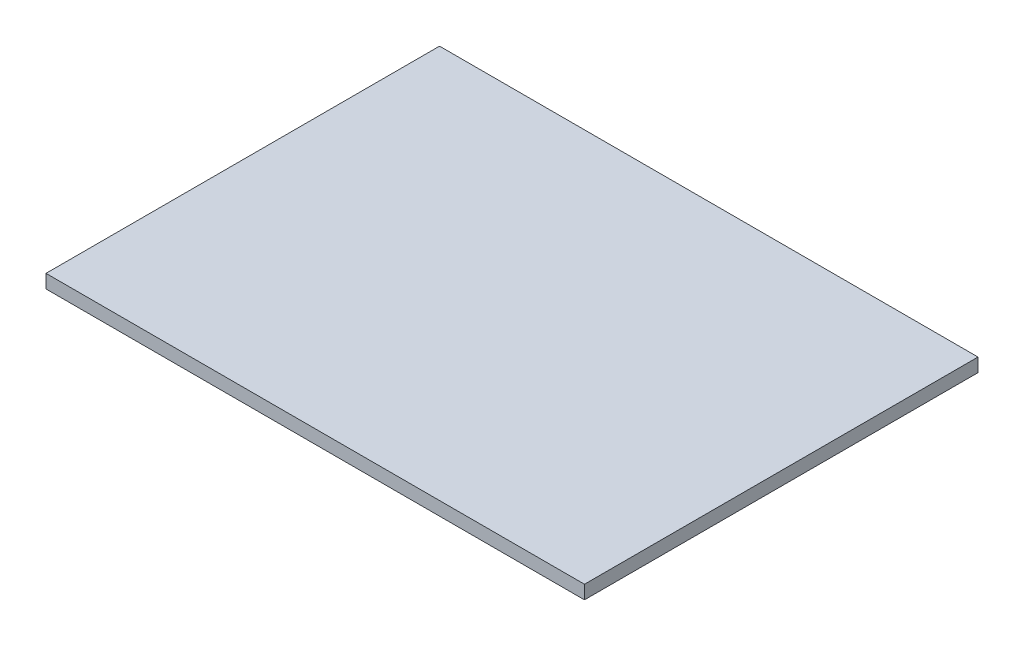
ISO-10303-21;
HEADER;
FILE_DESCRIPTION(('STEP AP214'),'2;1');
FILE_NAME('part.step','',(''),(''),'','','');
FILE_SCHEMA(('AUTOMOTIVE_DESIGN { 1 0 10303 214 1 1 1 1 }'));
ENDSEC;
DATA;
#1=APPLICATION_CONTEXT('core data for automotive mechanical design processes');
#2=APPLICATION_PROTOCOL_DEFINITION('international standard','automotive_design',2000,#1);
#3=PRODUCT_CONTEXT('',#1,'mechanical');
#4=PRODUCT('Part','Part','',(#3));
#5=PRODUCT_RELATED_PRODUCT_CATEGORY('part','',(#4));
#6=PRODUCT_DEFINITION_FORMATION('','',#4);
#7=PRODUCT_DEFINITION_CONTEXT('part definition',#1,'design');
#8=PRODUCT_DEFINITION('design','',#6,#7);
#9=PRODUCT_DEFINITION_SHAPE('','',#8);
#10=(LENGTH_UNIT() NAMED_UNIT(*) SI_UNIT(.MILLI.,.METRE.));
#11=(NAMED_UNIT(*) PLANE_ANGLE_UNIT() SI_UNIT($,.RADIAN.));
#12=(NAMED_UNIT(*) SI_UNIT($,.STERADIAN.) SOLID_ANGLE_UNIT());
#13=UNCERTAINTY_MEASURE_WITH_UNIT(LENGTH_MEASURE(1.E-05),#10,'distance_accuracy_value','');
#14=(GEOMETRIC_REPRESENTATION_CONTEXT(3) GLOBAL_UNCERTAINTY_ASSIGNED_CONTEXT((#13)) GLOBAL_UNIT_ASSIGNED_CONTEXT((#10,
#11,#12)) REPRESENTATION_CONTEXT('',''));
#15=CARTESIAN_POINT('',(0.,0.,0.));
#16=DIRECTION('',(0.,0.,1.));
#17=DIRECTION('',(1.,0.,0.));
#18=AXIS2_PLACEMENT_3D('',#15,#16,#17);
#19=CARTESIAN_POINT('',(-39.75,2.,29.05));
#20=DIRECTION('',(1.,0.,0.));
#21=DIRECTION('',(0.,0.,-1.));
#22=AXIS2_PLACEMENT_3D('',#19,#20,#21);
#23=PLANE('',#22);
#24=DIRECTION('',(0.,0.,1.));
#25=VECTOR('',#24,1.);
#26=CARTESIAN_POINT('',(-39.75,0.,29.05));
#27=LINE('',#26,#25);
#28=CARTESIAN_POINT('',(-39.75,0.,-29.05));
#29=VERTEX_POINT('',#28);
#30=CARTESIAN_POINT('',(-39.75,0.,29.05));
#31=VERTEX_POINT('',#30);
#32=EDGE_CURVE('E98',#29,#31,#27,.T.);
#33=ORIENTED_EDGE('',*,*,#32,.T.);
#34=DIRECTION('',(0.,-1.,0.));
#35=VECTOR('',#34,1.);
#36=CARTESIAN_POINT('',(-39.75,2.,29.05));
#37=LINE('',#36,#35);
#38=CARTESIAN_POINT('',(-39.75,2.,29.05));
#39=VERTEX_POINT('',#38);
#40=EDGE_CURVE('E11',#39,#31,#37,.T.);
#41=ORIENTED_EDGE('',*,*,#40,.F.);
#42=DIRECTION('',(0.,0.,1.));
#43=VECTOR('',#42,1.);
#44=CARTESIAN_POINT('',(-39.75,2.,29.05));
#45=LINE('',#44,#43);
#46=CARTESIAN_POINT('',(-39.75,2.,-29.05));
#47=VERTEX_POINT('',#46);
#48=EDGE_CURVE('E86',#47,#39,#45,.T.);
#49=ORIENTED_EDGE('',*,*,#48,.F.);
#50=DIRECTION('',(0.,-1.,0.));
#51=VECTOR('',#50,1.);
#52=CARTESIAN_POINT('',(-39.75,2.,-29.05));
#53=LINE('',#52,#51);
#54=EDGE_CURVE('E94',#47,#29,#53,.T.);
#55=ORIENTED_EDGE('',*,*,#54,.T.);
#56=EDGE_LOOP('',(#33,#41,#49,#55));
#57=FACE_BOUND('',#56,.T.);
#58=ADVANCED_FACE('F35',(#57),#23,.F.);
#59=CARTESIAN_POINT('',(39.75,2.,29.05));
#60=DIRECTION('',(0.,0.,-1.));
#61=DIRECTION('',(-1.,0.,0.));
#62=AXIS2_PLACEMENT_3D('',#59,#60,#61);
#63=PLANE('',#62);
#64=DIRECTION('',(1.,0.,0.));
#65=VECTOR('',#64,1.);
#66=CARTESIAN_POINT('',(39.75,0.,29.05));
#67=LINE('',#66,#65);
#68=CARTESIAN_POINT('',(39.75,0.,29.05));
#69=VERTEX_POINT('',#68);
#70=EDGE_CURVE('E90',#31,#69,#67,.T.);
#71=ORIENTED_EDGE('',*,*,#70,.T.);
#72=DIRECTION('',(0.,-1.,0.));
#73=VECTOR('',#72,1.);
#74=CARTESIAN_POINT('',(39.75,2.,29.05));
#75=LINE('',#74,#73);
#76=CARTESIAN_POINT('',(39.75,2.,29.05));
#77=VERTEX_POINT('',#76);
#78=EDGE_CURVE('E43',#77,#69,#75,.T.);
#79=ORIENTED_EDGE('',*,*,#78,.F.);
#80=DIRECTION('',(1.,0.,0.));
#81=VECTOR('',#80,1.);
#82=CARTESIAN_POINT('',(39.75,2.,29.05));
#83=LINE('',#82,#81);
#84=EDGE_CURVE('E81',#39,#77,#83,.T.);
#85=ORIENTED_EDGE('',*,*,#84,.F.);
#86=ORIENTED_EDGE('',*,*,#40,.T.);
#87=EDGE_LOOP('',(#71,#79,#85,#86));
#88=FACE_BOUND('',#87,.T.);
#89=ADVANCED_FACE('F89',(#88),#63,.F.);
#90=CARTESIAN_POINT('',(39.75,2.,29.05));
#91=DIRECTION('',(-1.,0.,0.));
#92=DIRECTION('',(0.,0.,1.));
#93=AXIS2_PLACEMENT_3D('',#90,#91,#92);
#94=PLANE('',#93);
#95=DIRECTION('',(0.,0.,-1.));
#96=VECTOR('',#95,1.);
#97=CARTESIAN_POINT('',(39.75,0.,29.05));
#98=LINE('',#97,#96);
#99=CARTESIAN_POINT('',(39.75,0.,-29.05));
#100=VERTEX_POINT('',#99);
#101=EDGE_CURVE('E68',#69,#100,#98,.T.);
#102=ORIENTED_EDGE('',*,*,#101,.T.);
#103=DIRECTION('',(0.,-1.,0.));
#104=VECTOR('',#103,1.);
#105=CARTESIAN_POINT('',(39.75,2.,-29.05));
#106=LINE('',#105,#104);
#107=CARTESIAN_POINT('',(39.75,2.,-29.05));
#108=VERTEX_POINT('',#107);
#109=EDGE_CURVE('E91',#108,#100,#106,.T.);
#110=ORIENTED_EDGE('',*,*,#109,.F.);
#111=DIRECTION('',(0.,0.,-1.));
#112=VECTOR('',#111,1.);
#113=CARTESIAN_POINT('',(39.75,2.,29.05));
#114=LINE('',#113,#112);
#115=EDGE_CURVE('E84',#77,#108,#114,.T.);
#116=ORIENTED_EDGE('',*,*,#115,.F.);
#117=ORIENTED_EDGE('',*,*,#78,.T.);
#118=EDGE_LOOP('',(#102,#110,#116,#117));
#119=FACE_BOUND('',#118,.T.);
#120=ADVANCED_FACE('F92',(#119),#94,.F.);
#121=CARTESIAN_POINT('',(39.75,2.,-29.05));
#122=DIRECTION('',(0.,0.,1.));
#123=DIRECTION('',(1.,0.,0.));
#124=AXIS2_PLACEMENT_3D('',#121,#122,#123);
#125=PLANE('',#124);
#126=DIRECTION('',(-1.,0.,0.));
#127=VECTOR('',#126,1.);
#128=CARTESIAN_POINT('',(39.75,0.,-29.05));
#129=LINE('',#128,#127);
#130=EDGE_CURVE('E74',#100,#29,#129,.T.);
#131=ORIENTED_EDGE('',*,*,#130,.T.);
#132=ORIENTED_EDGE('',*,*,#54,.F.);
#133=DIRECTION('',(-1.,0.,0.));
#134=VECTOR('',#133,1.);
#135=CARTESIAN_POINT('',(39.75,2.,-29.05));
#136=LINE('',#135,#134);
#137=EDGE_CURVE('E51',#108,#47,#136,.T.);
#138=ORIENTED_EDGE('',*,*,#137,.F.);
#139=ORIENTED_EDGE('',*,*,#109,.T.);
#140=EDGE_LOOP('',(#131,#132,#138,#139));
#141=FACE_BOUND('',#140,.T.);
#142=ADVANCED_FACE('F105',(#141),#125,.F.);
#143=CARTESIAN_POINT('',(0.,2.,0.));
#144=DIRECTION('',(0.,1.,0.));
#145=DIRECTION('',(0.,0.,1.));
#146=AXIS2_PLACEMENT_3D('',#143,#144,#145);
#147=PLANE('',#146);
#148=ORIENTED_EDGE('',*,*,#48,.T.);
#149=ORIENTED_EDGE('',*,*,#84,.T.);
#150=ORIENTED_EDGE('',*,*,#115,.T.);
#151=ORIENTED_EDGE('',*,*,#137,.T.);
#152=EDGE_LOOP('',(#148,#149,#150,#151));
#153=FACE_BOUND('',#152,.T.);
#154=ADVANCED_FACE('F82',(#153),#147,.T.);
#155=CARTESIAN_POINT('',(0.,0.,0.));
#156=DIRECTION('',(0.,1.,0.));
#157=DIRECTION('',(0.,0.,1.));
#158=AXIS2_PLACEMENT_3D('',#155,#156,#157);
#159=PLANE('',#158);
#160=ORIENTED_EDGE('',*,*,#32,.F.);
#161=ORIENTED_EDGE('',*,*,#130,.F.);
#162=ORIENTED_EDGE('',*,*,#101,.F.);
#163=ORIENTED_EDGE('',*,*,#70,.F.);
#164=EDGE_LOOP('',(#160,#161,#162,#163));
#165=FACE_BOUND('',#164,.T.);
#166=ADVANCED_FACE('F108',(#165),#159,.F.);
#167=CLOSED_SHELL('',(#58,#89,#120,#142,#154,#166));
#168=MANIFOLD_SOLID_BREP('B2',#167);
#169=ADVANCED_BREP_SHAPE_REPRESENTATION('',(#18,#168),#14);
#170=SHAPE_DEFINITION_REPRESENTATION(#9,#169);
ENDSEC;
END-ISO-10303-21;
